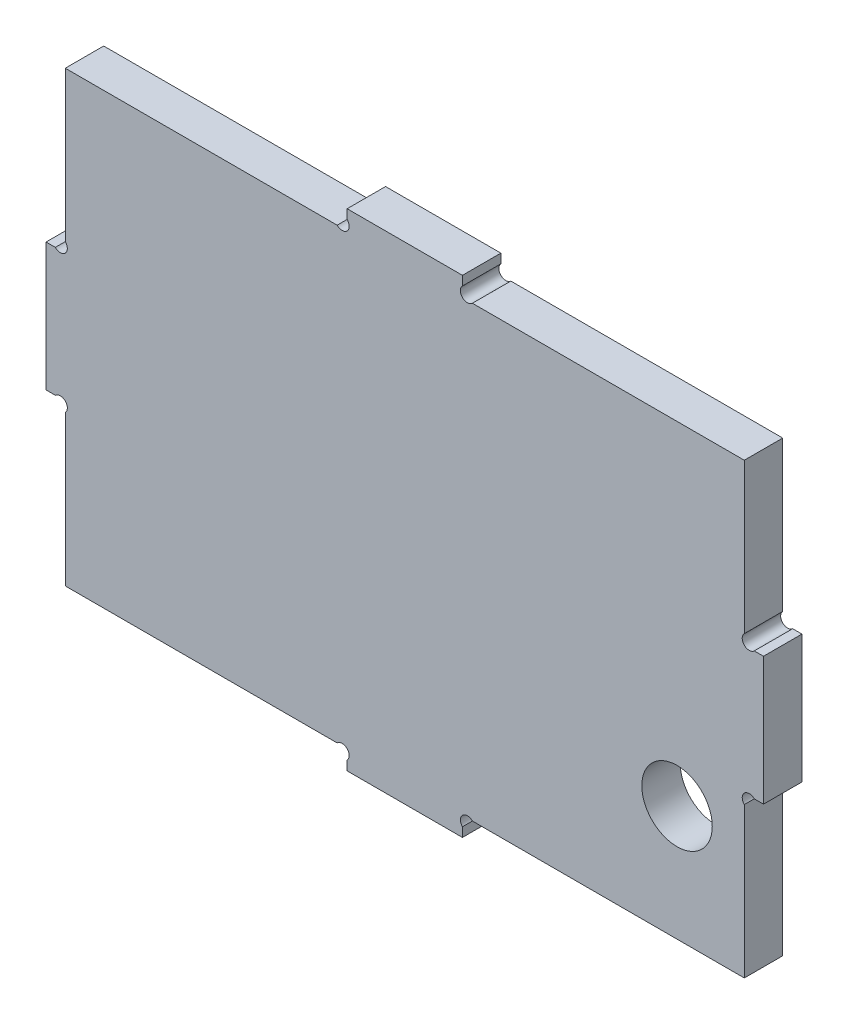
ISO-10303-21;
HEADER;
FILE_DESCRIPTION(('STEP AP214'),'2;1');
FILE_NAME('part.step','',(''),(''),'','','');
FILE_SCHEMA(('AUTOMOTIVE_DESIGN { 1 0 10303 214 1 1 1 1 }'));
ENDSEC;
DATA;
#1=APPLICATION_CONTEXT('core data for automotive mechanical design processes');
#2=APPLICATION_PROTOCOL_DEFINITION('international standard','automotive_design',2000,#1);
#3=PRODUCT_CONTEXT('',#1,'mechanical');
#4=PRODUCT('Part','Part','',(#3));
#5=PRODUCT_RELATED_PRODUCT_CATEGORY('part','',(#4));
#6=PRODUCT_DEFINITION_FORMATION('','',#4);
#7=PRODUCT_DEFINITION_CONTEXT('part definition',#1,'design');
#8=PRODUCT_DEFINITION('design','',#6,#7);
#9=PRODUCT_DEFINITION_SHAPE('','',#8);
#10=(LENGTH_UNIT() NAMED_UNIT(*) SI_UNIT(.MILLI.,.METRE.));
#11=(NAMED_UNIT(*) PLANE_ANGLE_UNIT() SI_UNIT($,.RADIAN.));
#12=(NAMED_UNIT(*) SI_UNIT($,.STERADIAN.) SOLID_ANGLE_UNIT());
#13=UNCERTAINTY_MEASURE_WITH_UNIT(LENGTH_MEASURE(1.E-05),#10,'distance_accuracy_value','');
#14=(GEOMETRIC_REPRESENTATION_CONTEXT(3) GLOBAL_UNCERTAINTY_ASSIGNED_CONTEXT((#13)) GLOBAL_UNIT_ASSIGNED_CONTEXT((#10,
#11,#12)) REPRESENTATION_CONTEXT('',''));
#15=CARTESIAN_POINT('',(0.,0.,0.));
#16=DIRECTION('',(0.,0.,1.));
#17=DIRECTION('',(1.,0.,0.));
#18=AXIS2_PLACEMENT_3D('',#15,#16,#17);
#19=CARTESIAN_POINT('',(65.7778174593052,70.7778174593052,6.));
#20=DIRECTION('',(0.,0.,1.));
#21=DIRECTION('',(1.,0.,0.));
#22=AXIS2_PLACEMENT_3D('',#19,#20,#21);
#23=PLANE('',#22);
#24=CARTESIAN_POINT('',(65.7778174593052,70.7778174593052,6.));
#25=DIRECTION('',(0.,0.,-1.));
#26=DIRECTION('',(1.,0.,0.));
#27=AXIS2_PLACEMENT_3D('',#24,#25,#26);
#28=CIRCLE('',#27,1.09999999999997);
#29=CARTESIAN_POINT('',(66.5556349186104,70.,6.));
#30=VERTEX_POINT('',#29);
#31=CARTESIAN_POINT('',(65.,71.5556349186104,6.));
#32=VERTEX_POINT('',#31);
#33=EDGE_CURVE('E307',#30,#32,#28,.T.);
#34=ORIENTED_EDGE('',*,*,#33,.T.);
#35=DIRECTION('',(0.,1.,0.));
#36=VECTOR('',#35,1.);
#37=CARTESIAN_POINT('',(65.,71.5556349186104,6.));
#38=LINE('',#37,#36);
#39=CARTESIAN_POINT('',(65.,73.,6.));
#40=VERTEX_POINT('',#39);
#41=EDGE_CURVE('E155',#32,#40,#38,.T.);
#42=ORIENTED_EDGE('',*,*,#41,.T.);
#43=DIRECTION('',(-1.,0.,0.));
#44=VECTOR('',#43,1.);
#45=CARTESIAN_POINT('',(47.,73.,6.));
#46=LINE('',#45,#44);
#47=CARTESIAN_POINT('',(47.,73.,6.));
#48=VERTEX_POINT('',#47);
#49=EDGE_CURVE('E382',#40,#48,#46,.T.);
#50=ORIENTED_EDGE('',*,*,#49,.T.);
#51=DIRECTION('',(0.,-1.,0.));
#52=VECTOR('',#51,1.);
#53=CARTESIAN_POINT('',(47.,71.5556349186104,6.));
#54=LINE('',#53,#52);
#55=CARTESIAN_POINT('',(47.,71.5556349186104,6.));
#56=VERTEX_POINT('',#55);
#57=EDGE_CURVE('E401',#48,#56,#54,.T.);
#58=ORIENTED_EDGE('',*,*,#57,.T.);
#59=CARTESIAN_POINT('',(46.2221825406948,70.7778174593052,6.));
#60=DIRECTION('',(0.,0.,-1.));
#61=DIRECTION('',(-1.,0.,0.));
#62=AXIS2_PLACEMENT_3D('',#59,#60,#61);
#63=CIRCLE('',#62,1.09999999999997);
#64=CARTESIAN_POINT('',(45.4443650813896,70.,6.));
#65=VERTEX_POINT('',#64);
#66=EDGE_CURVE('E398',#56,#65,#63,.T.);
#67=ORIENTED_EDGE('',*,*,#66,.T.);
#68=DIRECTION('',(-1.,0.,0.));
#69=VECTOR('',#68,1.);
#70=CARTESIAN_POINT('',(3.,70.,6.));
#71=LINE('',#70,#69);
#72=CARTESIAN_POINT('',(3.,70.,6.));
#73=VERTEX_POINT('',#72);
#74=EDGE_CURVE('E400',#65,#73,#71,.T.);
#75=ORIENTED_EDGE('',*,*,#74,.T.);
#76=DIRECTION('',(0.,-1.,0.));
#77=VECTOR('',#76,1.);
#78=CARTESIAN_POINT('',(3.,70.,6.));
#79=LINE('',#78,#77);
#80=CARTESIAN_POINT('',(3.00000000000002,46.5556349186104,6.));
#81=VERTEX_POINT('',#80);
#82=EDGE_CURVE('E403',#73,#81,#79,.T.);
#83=ORIENTED_EDGE('',*,*,#82,.T.);
#84=CARTESIAN_POINT('',(2.22218254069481,45.7778174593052,6.));
#85=DIRECTION('',(0.,0.,-1.));
#86=DIRECTION('',(-1.,0.,0.));
#87=AXIS2_PLACEMENT_3D('',#84,#85,#86);
#88=CIRCLE('',#87,1.1);
#89=CARTESIAN_POINT('',(1.4443650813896,45.,6.));
#90=VERTEX_POINT('',#89);
#91=EDGE_CURVE('E409',#81,#90,#88,.T.);
#92=ORIENTED_EDGE('',*,*,#91,.T.);
#93=DIRECTION('',(-1.,0.,0.));
#94=VECTOR('',#93,1.);
#95=CARTESIAN_POINT('',(1.44436508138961,45.,6.));
#96=LINE('',#95,#94);
#97=CARTESIAN_POINT('',(0.,45.,6.));
#98=VERTEX_POINT('',#97);
#99=EDGE_CURVE('E411',#90,#98,#96,.T.);
#100=ORIENTED_EDGE('',*,*,#99,.T.);
#101=DIRECTION('',(0.,-1.,0.));
#102=VECTOR('',#101,1.);
#103=CARTESIAN_POINT('',(0.,45.,6.));
#104=LINE('',#103,#102);
#105=CARTESIAN_POINT('',(0.,25.,6.));
#106=VERTEX_POINT('',#105);
#107=EDGE_CURVE('E413',#98,#106,#104,.T.);
#108=ORIENTED_EDGE('',*,*,#107,.T.);
#109=DIRECTION('',(1.,0.,0.));
#110=VECTOR('',#109,1.);
#111=CARTESIAN_POINT('',(0.,25.,6.));
#112=LINE('',#111,#110);
#113=CARTESIAN_POINT('',(1.44436508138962,25.,6.));
#114=VERTEX_POINT('',#113);
#115=EDGE_CURVE('E415',#106,#114,#112,.T.);
#116=ORIENTED_EDGE('',*,*,#115,.T.);
#117=CARTESIAN_POINT('',(2.22218254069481,24.2221825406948,6.));
#118=DIRECTION('',(0.,0.,-1.));
#119=DIRECTION('',(1.,0.,0.));
#120=AXIS2_PLACEMENT_3D('',#117,#118,#119);
#121=CIRCLE('',#120,1.09999999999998);
#122=CARTESIAN_POINT('',(3.00000000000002,23.4443650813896,6.));
#123=VERTEX_POINT('',#122);
#124=EDGE_CURVE('E417',#114,#123,#121,.T.);
#125=ORIENTED_EDGE('',*,*,#124,.T.);
#126=DIRECTION('',(0.,-1.,0.));
#127=VECTOR('',#126,1.);
#128=CARTESIAN_POINT('',(3.00000000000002,23.4443650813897,6.));
#129=LINE('',#128,#127);
#130=CARTESIAN_POINT('',(3.00000000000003,0.,6.));
#131=VERTEX_POINT('',#130);
#132=EDGE_CURVE('E419',#123,#131,#129,.T.);
#133=ORIENTED_EDGE('',*,*,#132,.T.);
#134=DIRECTION('',(1.,0.,0.));
#135=VECTOR('',#134,1.);
#136=CARTESIAN_POINT('',(45.4443650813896,0.,6.));
#137=LINE('',#136,#135);
#138=CARTESIAN_POINT('',(45.4443650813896,0.,6.));
#139=VERTEX_POINT('',#138);
#140=EDGE_CURVE('E421',#131,#139,#137,.T.);
#141=ORIENTED_EDGE('',*,*,#140,.T.);
#142=CARTESIAN_POINT('',(46.2221825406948,-0.777817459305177,6.));
#143=DIRECTION('',(0.,0.,-1.));
#144=DIRECTION('',(1.,0.,0.));
#145=AXIS2_PLACEMENT_3D('',#142,#143,#144);
#146=CIRCLE('',#145,1.09999999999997);
#147=CARTESIAN_POINT('',(47.,-1.55563491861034,6.));
#148=VERTEX_POINT('',#147);
#149=EDGE_CURVE('E423',#139,#148,#146,.T.);
#150=ORIENTED_EDGE('',*,*,#149,.T.);
#151=DIRECTION('',(0.,-1.,0.));
#152=VECTOR('',#151,1.);
#153=CARTESIAN_POINT('',(47.,-1.55563491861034,6.));
#154=LINE('',#153,#152);
#155=CARTESIAN_POINT('',(47.,-2.99999999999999,6.));
#156=VERTEX_POINT('',#155);
#157=EDGE_CURVE('E425',#148,#156,#154,.T.);
#158=ORIENTED_EDGE('',*,*,#157,.T.);
#159=DIRECTION('',(1.,0.,0.));
#160=VECTOR('',#159,1.);
#161=CARTESIAN_POINT('',(47.,-2.99999999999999,6.));
#162=LINE('',#161,#160);
#163=CARTESIAN_POINT('',(65.,-2.99999999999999,6.));
#164=VERTEX_POINT('',#163);
#165=EDGE_CURVE('E427',#156,#164,#162,.T.);
#166=ORIENTED_EDGE('',*,*,#165,.T.);
#167=DIRECTION('',(0.,1.,0.));
#168=VECTOR('',#167,1.);
#169=CARTESIAN_POINT('',(65.,-1.55563491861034,6.));
#170=LINE('',#169,#168);
#171=CARTESIAN_POINT('',(65.,-1.55563491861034,6.));
#172=VERTEX_POINT('',#171);
#173=EDGE_CURVE('E429',#164,#172,#170,.T.);
#174=ORIENTED_EDGE('',*,*,#173,.T.);
#175=CARTESIAN_POINT('',(65.7778174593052,-0.777817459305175,6.));
#176=DIRECTION('',(0.,0.,-1.));
#177=DIRECTION('',(-1.,0.,0.));
#178=AXIS2_PLACEMENT_3D('',#175,#176,#177);
#179=CIRCLE('',#178,1.09999999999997);
#180=CARTESIAN_POINT('',(66.5556349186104,0.,6.));
#181=VERTEX_POINT('',#180);
#182=EDGE_CURVE('E431',#172,#181,#179,.T.);
#183=ORIENTED_EDGE('',*,*,#182,.T.);
#184=DIRECTION('',(1.,0.,0.));
#185=VECTOR('',#184,1.);
#186=CARTESIAN_POINT('',(66.5556349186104,0.,6.));
#187=LINE('',#186,#185);
#188=CARTESIAN_POINT('',(109.,0.,6.));
#189=VERTEX_POINT('',#188);
#190=EDGE_CURVE('E433',#181,#189,#187,.T.);
#191=ORIENTED_EDGE('',*,*,#190,.T.);
#192=DIRECTION('',(0.,1.,0.));
#193=VECTOR('',#192,1.);
#194=CARTESIAN_POINT('',(109.,23.4443650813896,6.));
#195=LINE('',#194,#193);
#196=CARTESIAN_POINT('',(109.,23.4443650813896,6.));
#197=VERTEX_POINT('',#196);
#198=EDGE_CURVE('E435',#189,#197,#195,.T.);
#199=ORIENTED_EDGE('',*,*,#198,.T.);
#200=CARTESIAN_POINT('',(109.777817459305,24.2221825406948,6.));
#201=DIRECTION('',(0.,0.,-1.));
#202=DIRECTION('',(-1.,0.,0.));
#203=AXIS2_PLACEMENT_3D('',#200,#201,#202);
#204=CIRCLE('',#203,1.1);
#205=CARTESIAN_POINT('',(110.55563491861,25.,6.));
#206=VERTEX_POINT('',#205);
#207=EDGE_CURVE('E437',#197,#206,#204,.T.);
#208=ORIENTED_EDGE('',*,*,#207,.T.);
#209=DIRECTION('',(1.,0.,0.));
#210=VECTOR('',#209,1.);
#211=CARTESIAN_POINT('',(112.,25.,6.));
#212=LINE('',#211,#210);
#213=CARTESIAN_POINT('',(112.,25.,6.));
#214=VERTEX_POINT('',#213);
#215=EDGE_CURVE('E439',#206,#214,#212,.T.);
#216=ORIENTED_EDGE('',*,*,#215,.T.);
#217=DIRECTION('',(0.,1.,0.));
#218=VECTOR('',#217,1.);
#219=CARTESIAN_POINT('',(112.,45.,6.));
#220=LINE('',#219,#218);
#221=CARTESIAN_POINT('',(112.,45.,6.));
#222=VERTEX_POINT('',#221);
#223=EDGE_CURVE('E441',#214,#222,#220,.T.);
#224=ORIENTED_EDGE('',*,*,#223,.T.);
#225=DIRECTION('',(-1.,0.,0.));
#226=VECTOR('',#225,1.);
#227=CARTESIAN_POINT('',(110.55563491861,45.,6.));
#228=LINE('',#227,#226);
#229=CARTESIAN_POINT('',(110.55563491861,45.,6.));
#230=VERTEX_POINT('',#229);
#231=EDGE_CURVE('E234',#222,#230,#228,.T.);
#232=ORIENTED_EDGE('',*,*,#231,.T.);
#233=CARTESIAN_POINT('',(109.777817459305,45.7778174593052,6.));
#234=DIRECTION('',(0.,0.,-1.));
#235=DIRECTION('',(1.,0.,0.));
#236=AXIS2_PLACEMENT_3D('',#233,#234,#235);
#237=CIRCLE('',#236,1.1);
#238=CARTESIAN_POINT('',(109.,46.5556349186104,6.));
#239=VERTEX_POINT('',#238);
#240=EDGE_CURVE('E228',#230,#239,#237,.T.);
#241=ORIENTED_EDGE('',*,*,#240,.T.);
#242=DIRECTION('',(0.,1.,0.));
#243=VECTOR('',#242,1.);
#244=CARTESIAN_POINT('',(109.,70.,6.));
#245=LINE('',#244,#243);
#246=CARTESIAN_POINT('',(109.,70.,6.));
#247=VERTEX_POINT('',#246);
#248=EDGE_CURVE('E232',#239,#247,#245,.T.);
#249=ORIENTED_EDGE('',*,*,#248,.T.);
#250=DIRECTION('',(-1.,0.,0.));
#251=VECTOR('',#250,1.);
#252=CARTESIAN_POINT('',(66.5556349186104,70.,6.));
#253=LINE('',#252,#251);
#254=EDGE_CURVE('E52',#247,#30,#253,.T.);
#255=ORIENTED_EDGE('',*,*,#254,.T.);
#256=EDGE_LOOP('',(#34,#42,#50,#58,#67,#75,#83,#92,#100,#108,#116,#125,#133,#141,#150,#158,#166,
#174,#183,#191,#199,#208,#216,#224,#232,#241,#249,#255));
#257=FACE_BOUND('',#256,.T.);
#258=CARTESIAN_POINT('',(98.5,18.,6.));
#259=DIRECTION('',(0.,0.,1.));
#260=DIRECTION('',(1.,0.,0.));
#261=AXIS2_PLACEMENT_3D('',#258,#259,#260);
#262=CIRCLE('',#261,5.5);
#263=CARTESIAN_POINT('',(104.,18.,6.));
#264=VERTEX_POINT('',#263);
#265=EDGE_CURVE('E256',#264,#264,#262,.T.);
#266=ORIENTED_EDGE('',*,*,#265,.F.);
#267=EDGE_LOOP('',(#266));
#268=FACE_BOUND('',#267,.T.);
#269=ADVANCED_FACE('F35',(#257,#268),#23,.T.);
#270=CARTESIAN_POINT('',(65.7778174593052,70.7778174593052,0.));
#271=DIRECTION('',(0.,0.,1.));
#272=DIRECTION('',(1.,0.,0.));
#273=AXIS2_PLACEMENT_3D('',#270,#271,#272);
#274=PLANE('',#273);
#275=CARTESIAN_POINT('',(65.7778174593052,70.7778174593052,0.));
#276=DIRECTION('',(0.,0.,-1.));
#277=DIRECTION('',(1.,0.,0.));
#278=AXIS2_PLACEMENT_3D('',#275,#276,#277);
#279=CIRCLE('',#278,1.09999999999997);
#280=CARTESIAN_POINT('',(66.5556349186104,70.,0.));
#281=VERTEX_POINT('',#280);
#282=CARTESIAN_POINT('',(65.,71.5556349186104,0.));
#283=VERTEX_POINT('',#282);
#284=EDGE_CURVE('E252',#281,#283,#279,.T.);
#285=ORIENTED_EDGE('',*,*,#284,.F.);
#286=DIRECTION('',(-1.,0.,0.));
#287=VECTOR('',#286,1.);
#288=CARTESIAN_POINT('',(66.5556349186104,70.,0.));
#289=LINE('',#288,#287);
#290=CARTESIAN_POINT('',(109.,70.,0.));
#291=VERTEX_POINT('',#290);
#292=EDGE_CURVE('E147',#291,#281,#289,.T.);
#293=ORIENTED_EDGE('',*,*,#292,.F.);
#294=DIRECTION('',(0.,1.,0.));
#295=VECTOR('',#294,1.);
#296=CARTESIAN_POINT('',(109.,70.,0.));
#297=LINE('',#296,#295);
#298=CARTESIAN_POINT('',(109.,46.5556349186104,0.));
#299=VERTEX_POINT('',#298);
#300=EDGE_CURVE('E141',#299,#291,#297,.T.);
#301=ORIENTED_EDGE('',*,*,#300,.F.);
#302=CARTESIAN_POINT('',(109.777817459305,45.7778174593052,0.));
#303=DIRECTION('',(0.,0.,-1.));
#304=DIRECTION('',(1.,0.,0.));
#305=AXIS2_PLACEMENT_3D('',#302,#303,#304);
#306=CIRCLE('',#305,1.1);
#307=CARTESIAN_POINT('',(110.55563491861,45.,0.));
#308=VERTEX_POINT('',#307);
#309=EDGE_CURVE('E242',#308,#299,#306,.T.);
#310=ORIENTED_EDGE('',*,*,#309,.F.);
#311=DIRECTION('',(-1.,0.,0.));
#312=VECTOR('',#311,1.);
#313=CARTESIAN_POINT('',(110.55563491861,45.,0.));
#314=LINE('',#313,#312);
#315=CARTESIAN_POINT('',(112.,45.,0.));
#316=VERTEX_POINT('',#315);
#317=EDGE_CURVE('E302',#316,#308,#314,.T.);
#318=ORIENTED_EDGE('',*,*,#317,.F.);
#319=DIRECTION('',(0.,1.,0.));
#320=VECTOR('',#319,1.);
#321=CARTESIAN_POINT('',(112.,45.,0.));
#322=LINE('',#321,#320);
#323=CARTESIAN_POINT('',(112.,25.,0.));
#324=VERTEX_POINT('',#323);
#325=EDGE_CURVE('E300',#324,#316,#322,.T.);
#326=ORIENTED_EDGE('',*,*,#325,.F.);
#327=DIRECTION('',(1.,0.,0.));
#328=VECTOR('',#327,1.);
#329=CARTESIAN_POINT('',(112.,25.,0.));
#330=LINE('',#329,#328);
#331=CARTESIAN_POINT('',(110.55563491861,25.,0.));
#332=VERTEX_POINT('',#331);
#333=EDGE_CURVE('E298',#332,#324,#330,.T.);
#334=ORIENTED_EDGE('',*,*,#333,.F.);
#335=CARTESIAN_POINT('',(109.777817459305,24.2221825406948,0.));
#336=DIRECTION('',(0.,0.,-1.));
#337=DIRECTION('',(-1.,0.,0.));
#338=AXIS2_PLACEMENT_3D('',#335,#336,#337);
#339=CIRCLE('',#338,1.1);
#340=CARTESIAN_POINT('',(109.,23.4443650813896,0.));
#341=VERTEX_POINT('',#340);
#342=EDGE_CURVE('E296',#341,#332,#339,.T.);
#343=ORIENTED_EDGE('',*,*,#342,.F.);
#344=DIRECTION('',(0.,1.,0.));
#345=VECTOR('',#344,1.);
#346=CARTESIAN_POINT('',(109.,23.4443650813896,0.));
#347=LINE('',#346,#345);
#348=CARTESIAN_POINT('',(109.,0.,0.));
#349=VERTEX_POINT('',#348);
#350=EDGE_CURVE('E294',#349,#341,#347,.T.);
#351=ORIENTED_EDGE('',*,*,#350,.F.);
#352=DIRECTION('',(1.,0.,0.));
#353=VECTOR('',#352,1.);
#354=CARTESIAN_POINT('',(66.5556349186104,0.,0.));
#355=LINE('',#354,#353);
#356=CARTESIAN_POINT('',(66.5556349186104,0.,0.));
#357=VERTEX_POINT('',#356);
#358=EDGE_CURVE('E292',#357,#349,#355,.T.);
#359=ORIENTED_EDGE('',*,*,#358,.F.);
#360=CARTESIAN_POINT('',(65.7778174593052,-0.777817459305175,0.));
#361=DIRECTION('',(0.,0.,-1.));
#362=DIRECTION('',(-1.,0.,0.));
#363=AXIS2_PLACEMENT_3D('',#360,#361,#362);
#364=CIRCLE('',#363,1.09999999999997);
#365=CARTESIAN_POINT('',(65.,-1.55563491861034,0.));
#366=VERTEX_POINT('',#365);
#367=EDGE_CURVE('E290',#366,#357,#364,.T.);
#368=ORIENTED_EDGE('',*,*,#367,.F.);
#369=DIRECTION('',(0.,1.,0.));
#370=VECTOR('',#369,1.);
#371=CARTESIAN_POINT('',(65.,-1.55563491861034,0.));
#372=LINE('',#371,#370);
#373=CARTESIAN_POINT('',(65.,-2.99999999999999,0.));
#374=VERTEX_POINT('',#373);
#375=EDGE_CURVE('E288',#374,#366,#372,.T.);
#376=ORIENTED_EDGE('',*,*,#375,.F.);
#377=DIRECTION('',(1.,0.,0.));
#378=VECTOR('',#377,1.);
#379=CARTESIAN_POINT('',(47.,-2.99999999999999,0.));
#380=LINE('',#379,#378);
#381=CARTESIAN_POINT('',(47.,-2.99999999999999,0.));
#382=VERTEX_POINT('',#381);
#383=EDGE_CURVE('E286',#382,#374,#380,.T.);
#384=ORIENTED_EDGE('',*,*,#383,.F.);
#385=DIRECTION('',(0.,-1.,0.));
#386=VECTOR('',#385,1.);
#387=CARTESIAN_POINT('',(47.,-1.55563491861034,0.));
#388=LINE('',#387,#386);
#389=CARTESIAN_POINT('',(47.,-1.55563491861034,0.));
#390=VERTEX_POINT('',#389);
#391=EDGE_CURVE('E284',#390,#382,#388,.T.);
#392=ORIENTED_EDGE('',*,*,#391,.F.);
#393=CARTESIAN_POINT('',(46.2221825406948,-0.777817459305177,0.));
#394=DIRECTION('',(0.,0.,-1.));
#395=DIRECTION('',(1.,0.,0.));
#396=AXIS2_PLACEMENT_3D('',#393,#394,#395);
#397=CIRCLE('',#396,1.09999999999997);
#398=CARTESIAN_POINT('',(45.4443650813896,0.,0.));
#399=VERTEX_POINT('',#398);
#400=EDGE_CURVE('E282',#399,#390,#397,.T.);
#401=ORIENTED_EDGE('',*,*,#400,.F.);
#402=DIRECTION('',(1.,0.,0.));
#403=VECTOR('',#402,1.);
#404=CARTESIAN_POINT('',(45.4443650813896,0.,0.));
#405=LINE('',#404,#403);
#406=CARTESIAN_POINT('',(3.00000000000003,0.,0.));
#407=VERTEX_POINT('',#406);
#408=EDGE_CURVE('E280',#407,#399,#405,.T.);
#409=ORIENTED_EDGE('',*,*,#408,.F.);
#410=DIRECTION('',(0.,-1.,0.));
#411=VECTOR('',#410,1.);
#412=CARTESIAN_POINT('',(3.00000000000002,23.4443650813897,0.));
#413=LINE('',#412,#411);
#414=CARTESIAN_POINT('',(3.00000000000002,23.4443650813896,0.));
#415=VERTEX_POINT('',#414);
#416=EDGE_CURVE('E278',#415,#407,#413,.T.);
#417=ORIENTED_EDGE('',*,*,#416,.F.);
#418=CARTESIAN_POINT('',(2.22218254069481,24.2221825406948,0.));
#419=DIRECTION('',(0.,0.,-1.));
#420=DIRECTION('',(1.,0.,0.));
#421=AXIS2_PLACEMENT_3D('',#418,#419,#420);
#422=CIRCLE('',#421,1.09999999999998);
#423=CARTESIAN_POINT('',(1.44436508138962,25.,0.));
#424=VERTEX_POINT('',#423);
#425=EDGE_CURVE('E276',#424,#415,#422,.T.);
#426=ORIENTED_EDGE('',*,*,#425,.F.);
#427=DIRECTION('',(1.,0.,0.));
#428=VECTOR('',#427,1.);
#429=CARTESIAN_POINT('',(0.,25.,0.));
#430=LINE('',#429,#428);
#431=CARTESIAN_POINT('',(0.,25.,0.));
#432=VERTEX_POINT('',#431);
#433=EDGE_CURVE('E274',#432,#424,#430,.T.);
#434=ORIENTED_EDGE('',*,*,#433,.F.);
#435=DIRECTION('',(0.,-1.,0.));
#436=VECTOR('',#435,1.);
#437=CARTESIAN_POINT('',(0.,45.,0.));
#438=LINE('',#437,#436);
#439=CARTESIAN_POINT('',(0.,45.,0.));
#440=VERTEX_POINT('',#439);
#441=EDGE_CURVE('E272',#440,#432,#438,.T.);
#442=ORIENTED_EDGE('',*,*,#441,.F.);
#443=DIRECTION('',(-1.,0.,0.));
#444=VECTOR('',#443,1.);
#445=CARTESIAN_POINT('',(1.44436508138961,45.,0.));
#446=LINE('',#445,#444);
#447=CARTESIAN_POINT('',(1.4443650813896,45.,0.));
#448=VERTEX_POINT('',#447);
#449=EDGE_CURVE('E270',#448,#440,#446,.T.);
#450=ORIENTED_EDGE('',*,*,#449,.F.);
#451=CARTESIAN_POINT('',(2.22218254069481,45.7778174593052,0.));
#452=DIRECTION('',(0.,0.,-1.));
#453=DIRECTION('',(-1.,0.,0.));
#454=AXIS2_PLACEMENT_3D('',#451,#452,#453);
#455=CIRCLE('',#454,1.1);
#456=CARTESIAN_POINT('',(3.00000000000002,46.5556349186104,0.));
#457=VERTEX_POINT('',#456);
#458=EDGE_CURVE('E268',#457,#448,#455,.T.);
#459=ORIENTED_EDGE('',*,*,#458,.F.);
#460=DIRECTION('',(0.,-1.,0.));
#461=VECTOR('',#460,1.);
#462=CARTESIAN_POINT('',(3.,70.,0.));
#463=LINE('',#462,#461);
#464=CARTESIAN_POINT('',(3.,70.,0.));
#465=VERTEX_POINT('',#464);
#466=EDGE_CURVE('E266',#465,#457,#463,.T.);
#467=ORIENTED_EDGE('',*,*,#466,.F.);
#468=DIRECTION('',(-1.,0.,0.));
#469=VECTOR('',#468,1.);
#470=CARTESIAN_POINT('',(3.,70.,0.));
#471=LINE('',#470,#469);
#472=CARTESIAN_POINT('',(45.4443650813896,70.,0.));
#473=VERTEX_POINT('',#472);
#474=EDGE_CURVE('E264',#473,#465,#471,.T.);
#475=ORIENTED_EDGE('',*,*,#474,.F.);
#476=CARTESIAN_POINT('',(46.2221825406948,70.7778174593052,0.));
#477=DIRECTION('',(0.,0.,-1.));
#478=DIRECTION('',(-1.,0.,0.));
#479=AXIS2_PLACEMENT_3D('',#476,#477,#478);
#480=CIRCLE('',#479,1.09999999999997);
#481=CARTESIAN_POINT('',(47.,71.5556349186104,0.));
#482=VERTEX_POINT('',#481);
#483=EDGE_CURVE('E262',#482,#473,#480,.T.);
#484=ORIENTED_EDGE('',*,*,#483,.F.);
#485=DIRECTION('',(0.,-1.,0.));
#486=VECTOR('',#485,1.);
#487=CARTESIAN_POINT('',(47.,71.5556349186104,0.));
#488=LINE('',#487,#486);
#489=CARTESIAN_POINT('',(47.,73.,0.));
#490=VERTEX_POINT('',#489);
#491=EDGE_CURVE('E260',#490,#482,#488,.T.);
#492=ORIENTED_EDGE('',*,*,#491,.F.);
#493=DIRECTION('',(-1.,0.,0.));
#494=VECTOR('',#493,1.);
#495=CARTESIAN_POINT('',(47.,73.,0.));
#496=LINE('',#495,#494);
#497=CARTESIAN_POINT('',(65.,73.,0.));
#498=VERTEX_POINT('',#497);
#499=EDGE_CURVE('E258',#498,#490,#496,.T.);
#500=ORIENTED_EDGE('',*,*,#499,.F.);
#501=DIRECTION('',(0.,1.,0.));
#502=VECTOR('',#501,1.);
#503=CARTESIAN_POINT('',(65.,71.5556349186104,0.));
#504=LINE('',#503,#502);
#505=EDGE_CURVE('E255',#283,#498,#504,.T.);
#506=ORIENTED_EDGE('',*,*,#505,.F.);
#507=EDGE_LOOP('',(#285,#293,#301,#310,#318,#326,#334,#343,#351,#359,#368,#376,#384,#392,#401,
#409,#417,#426,#434,#442,#450,#459,#467,#475,#484,#492,#500,#506));
#508=FACE_BOUND('',#507,.T.);
#509=CARTESIAN_POINT('',(98.5,18.,0.));
#510=DIRECTION('',(0.,0.,1.));
#511=DIRECTION('',(1.,0.,0.));
#512=AXIS2_PLACEMENT_3D('',#509,#510,#511);
#513=CIRCLE('',#512,5.5);
#514=CARTESIAN_POINT('',(104.,18.,0.));
#515=VERTEX_POINT('',#514);
#516=EDGE_CURVE('E796',#515,#515,#513,.T.);
#517=ORIENTED_EDGE('',*,*,#516,.T.);
#518=EDGE_LOOP('',(#517));
#519=FACE_BOUND('',#518,.T.);
#520=ADVANCED_FACE('F386',(#508,#519),#274,.F.);
#521=CARTESIAN_POINT('',(65.7778174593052,70.7778174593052,6.));
#522=DIRECTION('',(0.,0.,-1.));
#523=DIRECTION('',(-1.,0.,0.));
#524=AXIS2_PLACEMENT_3D('',#521,#522,#523);
#525=CYLINDRICAL_SURFACE('',#524,1.09999999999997);
#526=ORIENTED_EDGE('',*,*,#284,.T.);
#527=DIRECTION('',(0.,0.,-1.));
#528=VECTOR('',#527,1.);
#529=CARTESIAN_POINT('',(65.,71.5556349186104,6.));
#530=LINE('',#529,#528);
#531=EDGE_CURVE('E11',#32,#283,#530,.T.);
#532=ORIENTED_EDGE('',*,*,#531,.F.);
#533=ORIENTED_EDGE('',*,*,#33,.F.);
#534=DIRECTION('',(0.,0.,-1.));
#535=VECTOR('',#534,1.);
#536=CARTESIAN_POINT('',(66.5556349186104,70.,6.));
#537=LINE('',#536,#535);
#538=EDGE_CURVE('E248',#30,#281,#537,.T.);
#539=ORIENTED_EDGE('',*,*,#538,.T.);
#540=EDGE_LOOP('',(#526,#532,#533,#539));
#541=FACE_BOUND('',#540,.T.);
#542=ADVANCED_FACE('F37',(#541),#525,.F.);
#543=CARTESIAN_POINT('',(65.,71.5556349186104,6.));
#544=DIRECTION('',(-1.,0.,0.));
#545=DIRECTION('',(0.,-1.,0.));
#546=AXIS2_PLACEMENT_3D('',#543,#544,#545);
#547=PLANE('',#546);
#548=ORIENTED_EDGE('',*,*,#505,.T.);
#549=DIRECTION('',(0.,0.,-1.));
#550=VECTOR('',#549,1.);
#551=CARTESIAN_POINT('',(65.,73.,6.));
#552=LINE('',#551,#550);
#553=EDGE_CURVE('E44',#40,#498,#552,.T.);
#554=ORIENTED_EDGE('',*,*,#553,.F.);
#555=ORIENTED_EDGE('',*,*,#41,.F.);
#556=ORIENTED_EDGE('',*,*,#531,.T.);
#557=EDGE_LOOP('',(#548,#554,#555,#556));
#558=FACE_BOUND('',#557,.T.);
#559=ADVANCED_FACE('F475',(#558),#547,.F.);
#560=CARTESIAN_POINT('',(47.,73.,6.));
#561=DIRECTION('',(0.,-1.,0.));
#562=DIRECTION('',(0.,0.,-1.));
#563=AXIS2_PLACEMENT_3D('',#560,#561,#562);
#564=PLANE('',#563);
#565=ORIENTED_EDGE('',*,*,#499,.T.);
#566=DIRECTION('',(0.,0.,-1.));
#567=VECTOR('',#566,1.);
#568=CARTESIAN_POINT('',(47.,73.,6.));
#569=LINE('',#568,#567);
#570=EDGE_CURVE('E374',#48,#490,#569,.T.);
#571=ORIENTED_EDGE('',*,*,#570,.F.);
#572=ORIENTED_EDGE('',*,*,#49,.F.);
#573=ORIENTED_EDGE('',*,*,#553,.T.);
#574=EDGE_LOOP('',(#565,#571,#572,#573));
#575=FACE_BOUND('',#574,.T.);
#576=ADVANCED_FACE('F380',(#575),#564,.F.);
#577=CARTESIAN_POINT('',(47.,71.5556349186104,6.));
#578=DIRECTION('',(1.,0.,0.));
#579=DIRECTION('',(0.,1.,0.));
#580=AXIS2_PLACEMENT_3D('',#577,#578,#579);
#581=PLANE('',#580);
#582=ORIENTED_EDGE('',*,*,#491,.T.);
#583=DIRECTION('',(0.,0.,-1.));
#584=VECTOR('',#583,1.);
#585=CARTESIAN_POINT('',(47.,71.5556349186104,6.));
#586=LINE('',#585,#584);
#587=EDGE_CURVE('E371',#56,#482,#586,.T.);
#588=ORIENTED_EDGE('',*,*,#587,.F.);
#589=ORIENTED_EDGE('',*,*,#57,.F.);
#590=ORIENTED_EDGE('',*,*,#570,.T.);
#591=EDGE_LOOP('',(#582,#588,#589,#590));
#592=FACE_BOUND('',#591,.T.);
#593=ADVANCED_FACE('F392',(#592),#581,.F.);
#594=CARTESIAN_POINT('',(46.2221825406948,70.7778174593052,6.));
#595=DIRECTION('',(0.,0.,-1.));
#596=DIRECTION('',(-1.,0.,0.));
#597=AXIS2_PLACEMENT_3D('',#594,#595,#596);
#598=CYLINDRICAL_SURFACE('',#597,1.09999999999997);
#599=ORIENTED_EDGE('',*,*,#483,.T.);
#600=DIRECTION('',(0.,0.,-1.));
#601=VECTOR('',#600,1.);
#602=CARTESIAN_POINT('',(45.4443650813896,70.,6.));
#603=LINE('',#602,#601);
#604=EDGE_CURVE('E368',#65,#473,#603,.T.);
#605=ORIENTED_EDGE('',*,*,#604,.F.);
#606=ORIENTED_EDGE('',*,*,#66,.F.);
#607=ORIENTED_EDGE('',*,*,#587,.T.);
#608=EDGE_LOOP('',(#599,#605,#606,#607));
#609=FACE_BOUND('',#608,.T.);
#610=ADVANCED_FACE('F396',(#609),#598,.F.);
#611=CARTESIAN_POINT('',(3.,70.,6.));
#612=DIRECTION('',(0.,-1.,0.));
#613=DIRECTION('',(0.,0.,-1.));
#614=AXIS2_PLACEMENT_3D('',#611,#612,#613);
#615=PLANE('',#614);
#616=ORIENTED_EDGE('',*,*,#474,.T.);
#617=DIRECTION('',(0.,0.,-1.));
#618=VECTOR('',#617,1.);
#619=CARTESIAN_POINT('',(3.,70.,6.));
#620=LINE('',#619,#618);
#621=EDGE_CURVE('E365',#73,#465,#620,.T.);
#622=ORIENTED_EDGE('',*,*,#621,.F.);
#623=ORIENTED_EDGE('',*,*,#74,.F.);
#624=ORIENTED_EDGE('',*,*,#604,.T.);
#625=EDGE_LOOP('',(#616,#622,#623,#624));
#626=FACE_BOUND('',#625,.T.);
#627=ADVANCED_FACE('F488',(#626),#615,.F.);
#628=CARTESIAN_POINT('',(3.,70.,6.));
#629=DIRECTION('',(1.,0.,0.));
#630=DIRECTION('',(0.,1.,0.));
#631=AXIS2_PLACEMENT_3D('',#628,#629,#630);
#632=PLANE('',#631);
#633=ORIENTED_EDGE('',*,*,#466,.T.);
#634=DIRECTION('',(0.,0.,-1.));
#635=VECTOR('',#634,1.);
#636=CARTESIAN_POINT('',(3.00000000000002,46.5556349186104,6.));
#637=LINE('',#636,#635);
#638=EDGE_CURVE('E362',#81,#457,#637,.T.);
#639=ORIENTED_EDGE('',*,*,#638,.F.);
#640=ORIENTED_EDGE('',*,*,#82,.F.);
#641=ORIENTED_EDGE('',*,*,#621,.T.);
#642=EDGE_LOOP('',(#633,#639,#640,#641));
#643=FACE_BOUND('',#642,.T.);
#644=ADVANCED_FACE('F491',(#643),#632,.F.);
#645=CARTESIAN_POINT('',(2.22218254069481,45.7778174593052,6.));
#646=DIRECTION('',(0.,0.,-1.));
#647=DIRECTION('',(-1.,0.,0.));
#648=AXIS2_PLACEMENT_3D('',#645,#646,#647);
#649=CYLINDRICAL_SURFACE('',#648,1.1);
#650=ORIENTED_EDGE('',*,*,#458,.T.);
#651=DIRECTION('',(0.,0.,-1.));
#652=VECTOR('',#651,1.);
#653=CARTESIAN_POINT('',(1.4443650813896,45.,6.));
#654=LINE('',#653,#652);
#655=EDGE_CURVE('E359',#90,#448,#654,.T.);
#656=ORIENTED_EDGE('',*,*,#655,.F.);
#657=ORIENTED_EDGE('',*,*,#91,.F.);
#658=ORIENTED_EDGE('',*,*,#638,.T.);
#659=EDGE_LOOP('',(#650,#656,#657,#658));
#660=FACE_BOUND('',#659,.T.);
#661=ADVANCED_FACE('F495',(#660),#649,.F.);
#662=CARTESIAN_POINT('',(1.44436508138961,45.,6.));
#663=DIRECTION('',(0.,-1.,0.));
#664=DIRECTION('',(1.,0.,0.));
#665=AXIS2_PLACEMENT_3D('',#662,#663,#664);
#666=PLANE('',#665);
#667=ORIENTED_EDGE('',*,*,#449,.T.);
#668=DIRECTION('',(0.,0.,-1.));
#669=VECTOR('',#668,1.);
#670=CARTESIAN_POINT('',(0.,45.,6.));
#671=LINE('',#670,#669);
#672=EDGE_CURVE('E356',#98,#440,#671,.T.);
#673=ORIENTED_EDGE('',*,*,#672,.F.);
#674=ORIENTED_EDGE('',*,*,#99,.F.);
#675=ORIENTED_EDGE('',*,*,#655,.T.);
#676=EDGE_LOOP('',(#667,#673,#674,#675));
#677=FACE_BOUND('',#676,.T.);
#678=ADVANCED_FACE('F499',(#677),#666,.F.);
#679=CARTESIAN_POINT('',(0.,45.,6.));
#680=DIRECTION('',(1.,0.,0.));
#681=DIRECTION('',(0.,0.,-1.));
#682=AXIS2_PLACEMENT_3D('',#679,#680,#681);
#683=PLANE('',#682);
#684=ORIENTED_EDGE('',*,*,#441,.T.);
#685=DIRECTION('',(0.,0.,-1.));
#686=VECTOR('',#685,1.);
#687=CARTESIAN_POINT('',(0.,25.,6.));
#688=LINE('',#687,#686);
#689=EDGE_CURVE('E353',#106,#432,#688,.T.);
#690=ORIENTED_EDGE('',*,*,#689,.F.);
#691=ORIENTED_EDGE('',*,*,#107,.F.);
#692=ORIENTED_EDGE('',*,*,#672,.T.);
#693=EDGE_LOOP('',(#684,#690,#691,#692));
#694=FACE_BOUND('',#693,.T.);
#695=ADVANCED_FACE('F503',(#694),#683,.F.);
#696=CARTESIAN_POINT('',(0.,25.,6.));
#697=DIRECTION('',(0.,1.,0.));
#698=DIRECTION('',(0.,0.,1.));
#699=AXIS2_PLACEMENT_3D('',#696,#697,#698);
#700=PLANE('',#699);
#701=ORIENTED_EDGE('',*,*,#433,.T.);
#702=DIRECTION('',(0.,0.,-1.));
#703=VECTOR('',#702,1.);
#704=CARTESIAN_POINT('',(1.44436508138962,25.,6.));
#705=LINE('',#704,#703);
#706=EDGE_CURVE('E350',#114,#424,#705,.T.);
#707=ORIENTED_EDGE('',*,*,#706,.F.);
#708=ORIENTED_EDGE('',*,*,#115,.F.);
#709=ORIENTED_EDGE('',*,*,#689,.T.);
#710=EDGE_LOOP('',(#701,#707,#708,#709));
#711=FACE_BOUND('',#710,.T.);
#712=ADVANCED_FACE('F507',(#711),#700,.F.);
#713=CARTESIAN_POINT('',(2.22218254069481,24.2221825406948,6.));
#714=DIRECTION('',(0.,0.,-1.));
#715=DIRECTION('',(-1.,0.,0.));
#716=AXIS2_PLACEMENT_3D('',#713,#714,#715);
#717=CYLINDRICAL_SURFACE('',#716,1.09999999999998);
#718=ORIENTED_EDGE('',*,*,#425,.T.);
#719=DIRECTION('',(0.,0.,-1.));
#720=VECTOR('',#719,1.);
#721=CARTESIAN_POINT('',(3.00000000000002,23.4443650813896,6.));
#722=LINE('',#721,#720);
#723=EDGE_CURVE('E347',#123,#415,#722,.T.);
#724=ORIENTED_EDGE('',*,*,#723,.F.);
#725=ORIENTED_EDGE('',*,*,#124,.F.);
#726=ORIENTED_EDGE('',*,*,#706,.T.);
#727=EDGE_LOOP('',(#718,#724,#725,#726));
#728=FACE_BOUND('',#727,.T.);
#729=ADVANCED_FACE('F511',(#728),#717,.F.);
#730=CARTESIAN_POINT('',(3.00000000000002,23.4443650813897,6.));
#731=DIRECTION('',(1.,0.,0.));
#732=DIRECTION('',(0.,1.,0.));
#733=AXIS2_PLACEMENT_3D('',#730,#731,#732);
#734=PLANE('',#733);
#735=ORIENTED_EDGE('',*,*,#416,.T.);
#736=DIRECTION('',(0.,0.,-1.));
#737=VECTOR('',#736,1.);
#738=CARTESIAN_POINT('',(3.00000000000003,0.,6.));
#739=LINE('',#738,#737);
#740=EDGE_CURVE('E344',#131,#407,#739,.T.);
#741=ORIENTED_EDGE('',*,*,#740,.F.);
#742=ORIENTED_EDGE('',*,*,#132,.F.);
#743=ORIENTED_EDGE('',*,*,#723,.T.);
#744=EDGE_LOOP('',(#735,#741,#742,#743));
#745=FACE_BOUND('',#744,.T.);
#746=ADVANCED_FACE('F515',(#745),#734,.F.);
#747=CARTESIAN_POINT('',(45.4443650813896,0.,6.));
#748=DIRECTION('',(0.,1.,0.));
#749=DIRECTION('',(-1.,0.,0.));
#750=AXIS2_PLACEMENT_3D('',#747,#748,#749);
#751=PLANE('',#750);
#752=ORIENTED_EDGE('',*,*,#408,.T.);
#753=DIRECTION('',(0.,0.,-1.));
#754=VECTOR('',#753,1.);
#755=CARTESIAN_POINT('',(45.4443650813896,0.,6.));
#756=LINE('',#755,#754);
#757=EDGE_CURVE('E341',#139,#399,#756,.T.);
#758=ORIENTED_EDGE('',*,*,#757,.F.);
#759=ORIENTED_EDGE('',*,*,#140,.F.);
#760=ORIENTED_EDGE('',*,*,#740,.T.);
#761=EDGE_LOOP('',(#752,#758,#759,#760));
#762=FACE_BOUND('',#761,.T.);
#763=ADVANCED_FACE('F519',(#762),#751,.F.);
#764=CARTESIAN_POINT('',(46.2221825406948,-0.777817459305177,6.));
#765=DIRECTION('',(0.,0.,-1.));
#766=DIRECTION('',(-1.,0.,0.));
#767=AXIS2_PLACEMENT_3D('',#764,#765,#766);
#768=CYLINDRICAL_SURFACE('',#767,1.09999999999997);
#769=ORIENTED_EDGE('',*,*,#400,.T.);
#770=DIRECTION('',(0.,0.,-1.));
#771=VECTOR('',#770,1.);
#772=CARTESIAN_POINT('',(47.,-1.55563491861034,6.));
#773=LINE('',#772,#771);
#774=EDGE_CURVE('E338',#148,#390,#773,.T.);
#775=ORIENTED_EDGE('',*,*,#774,.F.);
#776=ORIENTED_EDGE('',*,*,#149,.F.);
#777=ORIENTED_EDGE('',*,*,#757,.T.);
#778=EDGE_LOOP('',(#769,#775,#776,#777));
#779=FACE_BOUND('',#778,.T.);
#780=ADVANCED_FACE('F523',(#779),#768,.F.);
#781=CARTESIAN_POINT('',(47.,-1.55563491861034,6.));
#782=DIRECTION('',(1.,0.,0.));
#783=DIRECTION('',(0.,1.,0.));
#784=AXIS2_PLACEMENT_3D('',#781,#782,#783);
#785=PLANE('',#784);
#786=ORIENTED_EDGE('',*,*,#391,.T.);
#787=DIRECTION('',(0.,0.,-1.));
#788=VECTOR('',#787,1.);
#789=CARTESIAN_POINT('',(47.,-2.99999999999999,6.));
#790=LINE('',#789,#788);
#791=EDGE_CURVE('E335',#156,#382,#790,.T.);
#792=ORIENTED_EDGE('',*,*,#791,.F.);
#793=ORIENTED_EDGE('',*,*,#157,.F.);
#794=ORIENTED_EDGE('',*,*,#774,.T.);
#795=EDGE_LOOP('',(#786,#792,#793,#794));
#796=FACE_BOUND('',#795,.T.);
#797=ADVANCED_FACE('F527',(#796),#785,.F.);
#798=CARTESIAN_POINT('',(47.,-2.99999999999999,6.));
#799=DIRECTION('',(0.,1.,0.));
#800=DIRECTION('',(-1.,0.,0.));
#801=AXIS2_PLACEMENT_3D('',#798,#799,#800);
#802=PLANE('',#801);
#803=ORIENTED_EDGE('',*,*,#383,.T.);
#804=DIRECTION('',(0.,0.,-1.));
#805=VECTOR('',#804,1.);
#806=CARTESIAN_POINT('',(65.,-2.99999999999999,6.));
#807=LINE('',#806,#805);
#808=EDGE_CURVE('E332',#164,#374,#807,.T.);
#809=ORIENTED_EDGE('',*,*,#808,.F.);
#810=ORIENTED_EDGE('',*,*,#165,.F.);
#811=ORIENTED_EDGE('',*,*,#791,.T.);
#812=EDGE_LOOP('',(#803,#809,#810,#811));
#813=FACE_BOUND('',#812,.T.);
#814=ADVANCED_FACE('F531',(#813),#802,.F.);
#815=CARTESIAN_POINT('',(65.,-1.55563491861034,6.));
#816=DIRECTION('',(-1.,0.,0.));
#817=DIRECTION('',(0.,-1.,0.));
#818=AXIS2_PLACEMENT_3D('',#815,#816,#817);
#819=PLANE('',#818);
#820=ORIENTED_EDGE('',*,*,#375,.T.);
#821=DIRECTION('',(0.,0.,-1.));
#822=VECTOR('',#821,1.);
#823=CARTESIAN_POINT('',(65.,-1.55563491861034,6.));
#824=LINE('',#823,#822);
#825=EDGE_CURVE('E329',#172,#366,#824,.T.);
#826=ORIENTED_EDGE('',*,*,#825,.F.);
#827=ORIENTED_EDGE('',*,*,#173,.F.);
#828=ORIENTED_EDGE('',*,*,#808,.T.);
#829=EDGE_LOOP('',(#820,#826,#827,#828));
#830=FACE_BOUND('',#829,.T.);
#831=ADVANCED_FACE('F535',(#830),#819,.F.);
#832=CARTESIAN_POINT('',(65.7778174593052,-0.777817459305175,6.));
#833=DIRECTION('',(0.,0.,-1.));
#834=DIRECTION('',(-1.,0.,0.));
#835=AXIS2_PLACEMENT_3D('',#832,#833,#834);
#836=CYLINDRICAL_SURFACE('',#835,1.09999999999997);
#837=ORIENTED_EDGE('',*,*,#367,.T.);
#838=DIRECTION('',(0.,0.,-1.));
#839=VECTOR('',#838,1.);
#840=CARTESIAN_POINT('',(66.5556349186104,0.,6.));
#841=LINE('',#840,#839);
#842=EDGE_CURVE('E326',#181,#357,#841,.T.);
#843=ORIENTED_EDGE('',*,*,#842,.F.);
#844=ORIENTED_EDGE('',*,*,#182,.F.);
#845=ORIENTED_EDGE('',*,*,#825,.T.);
#846=EDGE_LOOP('',(#837,#843,#844,#845));
#847=FACE_BOUND('',#846,.T.);
#848=ADVANCED_FACE('F539',(#847),#836,.F.);
#849=CARTESIAN_POINT('',(66.5556349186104,0.,6.));
#850=DIRECTION('',(0.,1.,0.));
#851=DIRECTION('',(-1.,0.,0.));
#852=AXIS2_PLACEMENT_3D('',#849,#850,#851);
#853=PLANE('',#852);
#854=ORIENTED_EDGE('',*,*,#358,.T.);
#855=DIRECTION('',(0.,0.,-1.));
#856=VECTOR('',#855,1.);
#857=CARTESIAN_POINT('',(109.,0.,6.));
#858=LINE('',#857,#856);
#859=EDGE_CURVE('E323',#189,#349,#858,.T.);
#860=ORIENTED_EDGE('',*,*,#859,.F.);
#861=ORIENTED_EDGE('',*,*,#190,.F.);
#862=ORIENTED_EDGE('',*,*,#842,.T.);
#863=EDGE_LOOP('',(#854,#860,#861,#862));
#864=FACE_BOUND('',#863,.T.);
#865=ADVANCED_FACE('F543',(#864),#853,.F.);
#866=CARTESIAN_POINT('',(109.,23.4443650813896,6.));
#867=DIRECTION('',(-1.,0.,0.));
#868=DIRECTION('',(0.,0.,1.));
#869=AXIS2_PLACEMENT_3D('',#866,#867,#868);
#870=PLANE('',#869);
#871=ORIENTED_EDGE('',*,*,#350,.T.);
#872=DIRECTION('',(0.,0.,-1.));
#873=VECTOR('',#872,1.);
#874=CARTESIAN_POINT('',(109.,23.4443650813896,6.));
#875=LINE('',#874,#873);
#876=EDGE_CURVE('E320',#197,#341,#875,.T.);
#877=ORIENTED_EDGE('',*,*,#876,.F.);
#878=ORIENTED_EDGE('',*,*,#198,.F.);
#879=ORIENTED_EDGE('',*,*,#859,.T.);
#880=EDGE_LOOP('',(#871,#877,#878,#879));
#881=FACE_BOUND('',#880,.T.);
#882=ADVANCED_FACE('F547',(#881),#870,.F.);
#883=CARTESIAN_POINT('',(109.777817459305,24.2221825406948,6.));
#884=DIRECTION('',(0.,0.,-1.));
#885=DIRECTION('',(-1.,0.,0.));
#886=AXIS2_PLACEMENT_3D('',#883,#884,#885);
#887=CYLINDRICAL_SURFACE('',#886,1.1);
#888=ORIENTED_EDGE('',*,*,#342,.T.);
#889=DIRECTION('',(0.,0.,-1.));
#890=VECTOR('',#889,1.);
#891=CARTESIAN_POINT('',(110.55563491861,25.,6.));
#892=LINE('',#891,#890);
#893=EDGE_CURVE('E317',#206,#332,#892,.T.);
#894=ORIENTED_EDGE('',*,*,#893,.F.);
#895=ORIENTED_EDGE('',*,*,#207,.F.);
#896=ORIENTED_EDGE('',*,*,#876,.T.);
#897=EDGE_LOOP('',(#888,#894,#895,#896));
#898=FACE_BOUND('',#897,.T.);
#899=ADVANCED_FACE('F551',(#898),#887,.F.);
#900=CARTESIAN_POINT('',(112.,25.,6.));
#901=DIRECTION('',(0.,1.,0.));
#902=DIRECTION('',(0.,0.,1.));
#903=AXIS2_PLACEMENT_3D('',#900,#901,#902);
#904=PLANE('',#903);
#905=ORIENTED_EDGE('',*,*,#333,.T.);
#906=DIRECTION('',(0.,0.,-1.));
#907=VECTOR('',#906,1.);
#908=CARTESIAN_POINT('',(112.,25.,6.));
#909=LINE('',#908,#907);
#910=EDGE_CURVE('E314',#214,#324,#909,.T.);
#911=ORIENTED_EDGE('',*,*,#910,.F.);
#912=ORIENTED_EDGE('',*,*,#215,.F.);
#913=ORIENTED_EDGE('',*,*,#893,.T.);
#914=EDGE_LOOP('',(#905,#911,#912,#913));
#915=FACE_BOUND('',#914,.T.);
#916=ADVANCED_FACE('F555',(#915),#904,.F.);
#917=CARTESIAN_POINT('',(112.,45.,6.));
#918=DIRECTION('',(-1.,0.,0.));
#919=DIRECTION('',(0.,0.,1.));
#920=AXIS2_PLACEMENT_3D('',#917,#918,#919);
#921=PLANE('',#920);
#922=ORIENTED_EDGE('',*,*,#325,.T.);
#923=DIRECTION('',(0.,0.,-1.));
#924=VECTOR('',#923,1.);
#925=CARTESIAN_POINT('',(112.,45.,6.));
#926=LINE('',#925,#924);
#927=EDGE_CURVE('E311',#222,#316,#926,.T.);
#928=ORIENTED_EDGE('',*,*,#927,.F.);
#929=ORIENTED_EDGE('',*,*,#223,.F.);
#930=ORIENTED_EDGE('',*,*,#910,.T.);
#931=EDGE_LOOP('',(#922,#928,#929,#930));
#932=FACE_BOUND('',#931,.T.);
#933=ADVANCED_FACE('F447',(#932),#921,.F.);
#934=CARTESIAN_POINT('',(110.55563491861,45.,6.));
#935=DIRECTION('',(0.,-1.,0.));
#936=DIRECTION('',(1.,0.,0.));
#937=AXIS2_PLACEMENT_3D('',#934,#935,#936);
#938=PLANE('',#937);
#939=ORIENTED_EDGE('',*,*,#317,.T.);
#940=DIRECTION('',(0.,0.,-1.));
#941=VECTOR('',#940,1.);
#942=CARTESIAN_POINT('',(110.55563491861,45.,6.));
#943=LINE('',#942,#941);
#944=EDGE_CURVE('E243',#230,#308,#943,.T.);
#945=ORIENTED_EDGE('',*,*,#944,.F.);
#946=ORIENTED_EDGE('',*,*,#231,.F.);
#947=ORIENTED_EDGE('',*,*,#927,.T.);
#948=EDGE_LOOP('',(#939,#945,#946,#947));
#949=FACE_BOUND('',#948,.T.);
#950=ADVANCED_FACE('F451',(#949),#938,.F.);
#951=CARTESIAN_POINT('',(109.777817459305,45.7778174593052,6.));
#952=DIRECTION('',(0.,0.,-1.));
#953=DIRECTION('',(-1.,0.,0.));
#954=AXIS2_PLACEMENT_3D('',#951,#952,#953);
#955=CYLINDRICAL_SURFACE('',#954,1.1);
#956=ORIENTED_EDGE('',*,*,#309,.T.);
#957=DIRECTION('',(0.,0.,-1.));
#958=VECTOR('',#957,1.);
#959=CARTESIAN_POINT('',(109.,46.5556349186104,6.));
#960=LINE('',#959,#958);
#961=EDGE_CURVE('E239',#239,#299,#960,.T.);
#962=ORIENTED_EDGE('',*,*,#961,.F.);
#963=ORIENTED_EDGE('',*,*,#240,.F.);
#964=ORIENTED_EDGE('',*,*,#944,.T.);
#965=EDGE_LOOP('',(#956,#962,#963,#964));
#966=FACE_BOUND('',#965,.T.);
#967=ADVANCED_FACE('F240',(#966),#955,.F.);
#968=CARTESIAN_POINT('',(109.,70.,6.));
#969=DIRECTION('',(-1.,0.,0.));
#970=DIRECTION('',(0.,0.,1.));
#971=AXIS2_PLACEMENT_3D('',#968,#969,#970);
#972=PLANE('',#971);
#973=ORIENTED_EDGE('',*,*,#300,.T.);
#974=DIRECTION('',(0.,0.,-1.));
#975=VECTOR('',#974,1.);
#976=CARTESIAN_POINT('',(109.,70.,6.));
#977=LINE('',#976,#975);
#978=EDGE_CURVE('E244',#247,#291,#977,.T.);
#979=ORIENTED_EDGE('',*,*,#978,.F.);
#980=ORIENTED_EDGE('',*,*,#248,.F.);
#981=ORIENTED_EDGE('',*,*,#961,.T.);
#982=EDGE_LOOP('',(#973,#979,#980,#981));
#983=FACE_BOUND('',#982,.T.);
#984=ADVANCED_FACE('F246',(#983),#972,.F.);
#985=CARTESIAN_POINT('',(66.5556349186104,70.,6.));
#986=DIRECTION('',(0.,-1.,0.));
#987=DIRECTION('',(0.,0.,-1.));
#988=AXIS2_PLACEMENT_3D('',#985,#986,#987);
#989=PLANE('',#988);
#990=ORIENTED_EDGE('',*,*,#292,.T.);
#991=ORIENTED_EDGE('',*,*,#538,.F.);
#992=ORIENTED_EDGE('',*,*,#254,.F.);
#993=ORIENTED_EDGE('',*,*,#978,.T.);
#994=EDGE_LOOP('',(#990,#991,#992,#993));
#995=FACE_BOUND('',#994,.T.);
#996=ADVANCED_FACE('F455',(#995),#989,.F.);
#997=CARTESIAN_POINT('',(98.5,18.,6.));
#998=DIRECTION('',(0.,0.,-1.));
#999=DIRECTION('',(-1.,0.,0.));
#1000=AXIS2_PLACEMENT_3D('',#997,#998,#999);
#1001=CYLINDRICAL_SURFACE('',#1000,5.5);
#1002=ORIENTED_EDGE('',*,*,#265,.T.);
#1003=EDGE_LOOP('',(#1002));
#1004=FACE_BOUND('',#1003,.T.);
#1005=ORIENTED_EDGE('',*,*,#516,.F.);
#1006=EDGE_LOOP('',(#1005));
#1007=FACE_BOUND('',#1006,.T.);
#1008=ADVANCED_FACE('F457',(#1004,#1007),#1001,.F.);
#1009=CLOSED_SHELL('',(#269,#520,#542,#559,#576,#593,#610,#627,#644,#661,#678,#695,#712,#729,
#746,#763,#780,#797,#814,#831,#848,#865,#882,#899,#916,#933,#950,#967,#984,#996,#1008));
#1010=MANIFOLD_SOLID_BREP('B2',#1009);
#1011=ADVANCED_BREP_SHAPE_REPRESENTATION('',(#18,#1010),#14);
#1012=SHAPE_DEFINITION_REPRESENTATION(#9,#1011);
ENDSEC;
END-ISO-10303-21;
